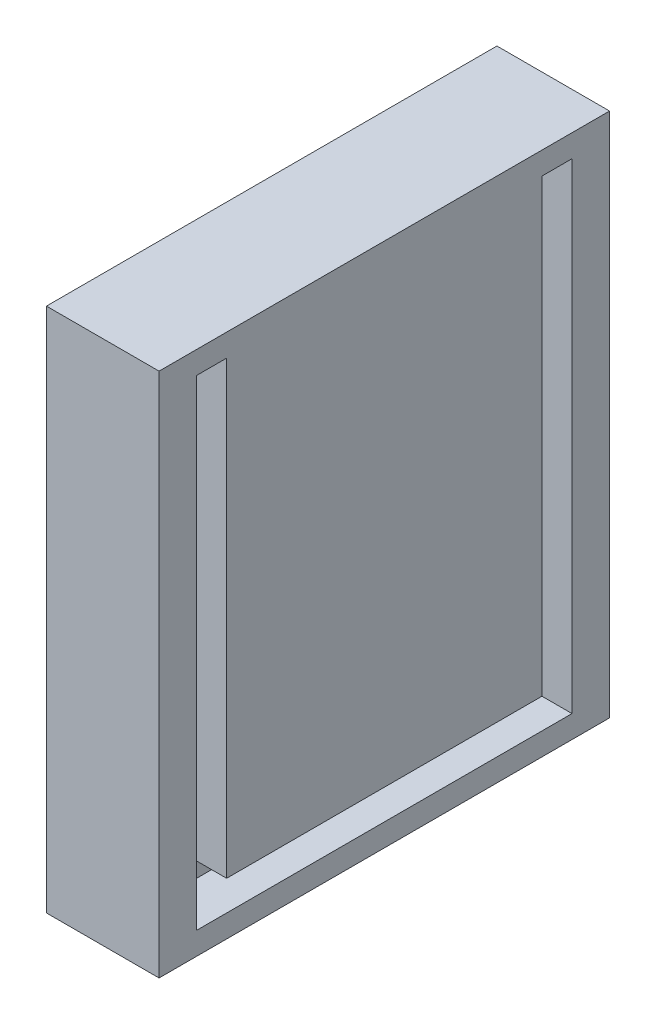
ISO-10303-21;
HEADER;
FILE_DESCRIPTION(('STEP AP214'),'2;1');
FILE_NAME('part.step','',(''),(''),'','','');
FILE_SCHEMA(('AUTOMOTIVE_DESIGN { 1 0 10303 214 1 1 1 1 }'));
ENDSEC;
DATA;
#1=APPLICATION_CONTEXT('core data for automotive mechanical design processes');
#2=APPLICATION_PROTOCOL_DEFINITION('international standard','automotive_design',2000,#1);
#3=PRODUCT_CONTEXT('',#1,'mechanical');
#4=PRODUCT('Part','Part','',(#3));
#5=PRODUCT_RELATED_PRODUCT_CATEGORY('part','',(#4));
#6=PRODUCT_DEFINITION_FORMATION('','',#4);
#7=PRODUCT_DEFINITION_CONTEXT('part definition',#1,'design');
#8=PRODUCT_DEFINITION('design','',#6,#7);
#9=PRODUCT_DEFINITION_SHAPE('','',#8);
#10=(LENGTH_UNIT() NAMED_UNIT(*) SI_UNIT(.MILLI.,.METRE.));
#11=(NAMED_UNIT(*) PLANE_ANGLE_UNIT() SI_UNIT($,.RADIAN.));
#12=(NAMED_UNIT(*) SI_UNIT($,.STERADIAN.) SOLID_ANGLE_UNIT());
#13=UNCERTAINTY_MEASURE_WITH_UNIT(LENGTH_MEASURE(1.E-05),#10,'distance_accuracy_value','');
#14=(GEOMETRIC_REPRESENTATION_CONTEXT(3) GLOBAL_UNCERTAINTY_ASSIGNED_CONTEXT((#13)) GLOBAL_UNIT_ASSIGNED_CONTEXT((#10,
#11,#12)) REPRESENTATION_CONTEXT('',''));
#15=CARTESIAN_POINT('',(0.,0.,0.));
#16=DIRECTION('',(0.,0.,1.));
#17=DIRECTION('',(1.,0.,0.));
#18=AXIS2_PLACEMENT_3D('',#15,#16,#17);
#19=CARTESIAN_POINT('',(7.5,0.,0.));
#20=DIRECTION('',(0.,1.,0.));
#21=DIRECTION('',(0.,0.,1.));
#22=AXIS2_PLACEMENT_3D('',#19,#20,#21);
#23=PLANE('',#22);
#24=DIRECTION('',(0.,0.,-1.));
#25=VECTOR('',#24,1.);
#26=CARTESIAN_POINT('',(0.,0.,0.));
#27=LINE('',#26,#25);
#28=CARTESIAN_POINT('',(0.,0.,0.));
#29=VERTEX_POINT('',#28);
#30=CARTESIAN_POINT('',(0.,0.,-30.));
#31=VERTEX_POINT('',#30);
#32=EDGE_CURVE('E265',#29,#31,#27,.T.);
#33=ORIENTED_EDGE('',*,*,#32,.T.);
#34=DIRECTION('',(-1.,0.,0.));
#35=VECTOR('',#34,1.);
#36=CARTESIAN_POINT('',(7.5,0.,-30.));
#37=LINE('',#36,#35);
#38=CARTESIAN_POINT('',(7.5,0.,-30.));
#39=VERTEX_POINT('',#38);
#40=EDGE_CURVE('E11',#39,#31,#37,.T.);
#41=ORIENTED_EDGE('',*,*,#40,.F.);
#42=DIRECTION('',(0.,0.,-1.));
#43=VECTOR('',#42,1.);
#44=CARTESIAN_POINT('',(7.5,0.,0.));
#45=LINE('',#44,#43);
#46=CARTESIAN_POINT('',(7.5,0.,0.));
#47=VERTEX_POINT('',#46);
#48=EDGE_CURVE('E269',#47,#39,#45,.T.);
#49=ORIENTED_EDGE('',*,*,#48,.F.);
#50=DIRECTION('',(-1.,0.,0.));
#51=VECTOR('',#50,1.);
#52=CARTESIAN_POINT('',(7.5,0.,0.));
#53=LINE('',#52,#51);
#54=EDGE_CURVE('E69',#47,#29,#53,.T.);
#55=ORIENTED_EDGE('',*,*,#54,.T.);
#56=EDGE_LOOP('',(#33,#41,#49,#55));
#57=FACE_BOUND('',#56,.T.);
#58=ADVANCED_FACE('F45',(#57),#23,.F.);
#59=CARTESIAN_POINT('',(7.5,0.,-30.));
#60=DIRECTION('',(0.,0.,1.));
#61=DIRECTION('',(0.,-1.,0.));
#62=AXIS2_PLACEMENT_3D('',#59,#60,#61);
#63=PLANE('',#62);
#64=DIRECTION('',(0.,1.,0.));
#65=VECTOR('',#64,1.);
#66=CARTESIAN_POINT('',(0.,0.,-30.));
#67=LINE('',#66,#65);
#68=CARTESIAN_POINT('',(0.,35.,-30.));
#69=VERTEX_POINT('',#68);
#70=EDGE_CURVE('E284',#31,#69,#67,.T.);
#71=ORIENTED_EDGE('',*,*,#70,.T.);
#72=DIRECTION('',(-1.,0.,0.));
#73=VECTOR('',#72,1.);
#74=CARTESIAN_POINT('',(7.5,35.,-30.));
#75=LINE('',#74,#73);
#76=CARTESIAN_POINT('',(7.5,35.,-30.));
#77=VERTEX_POINT('',#76);
#78=EDGE_CURVE('E53',#77,#69,#75,.T.);
#79=ORIENTED_EDGE('',*,*,#78,.F.);
#80=DIRECTION('',(0.,1.,0.));
#81=VECTOR('',#80,1.);
#82=CARTESIAN_POINT('',(7.5,0.,-30.));
#83=LINE('',#82,#81);
#84=EDGE_CURVE('E95',#39,#77,#83,.T.);
#85=ORIENTED_EDGE('',*,*,#84,.F.);
#86=ORIENTED_EDGE('',*,*,#40,.T.);
#87=EDGE_LOOP('',(#71,#79,#85,#86));
#88=FACE_BOUND('',#87,.T.);
#89=ADVANCED_FACE('F304',(#88),#63,.F.);
#90=CARTESIAN_POINT('',(7.5,35.,0.));
#91=DIRECTION('',(0.,1.,0.));
#92=DIRECTION('',(0.,0.,1.));
#93=AXIS2_PLACEMENT_3D('',#90,#91,#92);
#94=PLANE('',#93);
#95=DIRECTION('',(0.,0.,-1.));
#96=VECTOR('',#95,1.);
#97=CARTESIAN_POINT('',(0.,35.,0.));
#98=LINE('',#97,#96);
#99=CARTESIAN_POINT('',(0.,35.,0.));
#100=VERTEX_POINT('',#99);
#101=EDGE_CURVE('E288',#100,#69,#98,.T.);
#102=ORIENTED_EDGE('',*,*,#101,.F.);
#103=DIRECTION('',(-1.,0.,0.));
#104=VECTOR('',#103,1.);
#105=CARTESIAN_POINT('',(7.5,35.,0.));
#106=LINE('',#105,#104);
#107=CARTESIAN_POINT('',(7.5,35.,0.));
#108=VERTEX_POINT('',#107);
#109=EDGE_CURVE('E297',#108,#100,#106,.T.);
#110=ORIENTED_EDGE('',*,*,#109,.F.);
#111=DIRECTION('',(0.,0.,-1.));
#112=VECTOR('',#111,1.);
#113=CARTESIAN_POINT('',(7.5,35.,0.));
#114=LINE('',#113,#112);
#115=EDGE_CURVE('E275',#108,#77,#114,.T.);
#116=ORIENTED_EDGE('',*,*,#115,.T.);
#117=ORIENTED_EDGE('',*,*,#78,.T.);
#118=EDGE_LOOP('',(#102,#110,#116,#117));
#119=FACE_BOUND('',#118,.T.);
#120=ADVANCED_FACE('F302',(#119),#94,.T.);
#121=CARTESIAN_POINT('',(7.5,0.,0.));
#122=DIRECTION('',(0.,0.,1.));
#123=DIRECTION('',(1.,0.,0.));
#124=AXIS2_PLACEMENT_3D('',#121,#122,#123);
#125=PLANE('',#124);
#126=DIRECTION('',(0.,1.,0.));
#127=VECTOR('',#126,1.);
#128=CARTESIAN_POINT('',(0.,0.,0.));
#129=LINE('',#128,#127);
#130=EDGE_CURVE('E272',#29,#100,#129,.T.);
#131=ORIENTED_EDGE('',*,*,#130,.F.);
#132=ORIENTED_EDGE('',*,*,#54,.F.);
#133=DIRECTION('',(0.,1.,0.));
#134=VECTOR('',#133,1.);
#135=CARTESIAN_POINT('',(7.5,0.,0.));
#136=LINE('',#135,#134);
#137=EDGE_CURVE('E279',#47,#108,#136,.T.);
#138=ORIENTED_EDGE('',*,*,#137,.T.);
#139=ORIENTED_EDGE('',*,*,#109,.T.);
#140=EDGE_LOOP('',(#131,#132,#138,#139));
#141=FACE_BOUND('',#140,.T.);
#142=ADVANCED_FACE('F308',(#141),#125,.T.);
#143=CARTESIAN_POINT('',(7.5,0.,0.));
#144=DIRECTION('',(1.,0.,0.));
#145=DIRECTION('',(0.,0.,-1.));
#146=AXIS2_PLACEMENT_3D('',#143,#144,#145);
#147=PLANE('',#146);
#148=DIRECTION('',(0.,0.,1.));
#149=VECTOR('',#148,1.);
#150=CARTESIAN_POINT('',(7.5,33.5,-4.5));
#151=LINE('',#150,#149);
#152=CARTESIAN_POINT('',(7.5,33.5,-4.5));
#153=VERTEX_POINT('',#152);
#154=CARTESIAN_POINT('',(7.5,33.5,-2.5));
#155=VERTEX_POINT('',#154);
#156=EDGE_CURVE('E60',#153,#155,#151,.T.);
#157=ORIENTED_EDGE('',*,*,#156,.F.);
#158=DIRECTION('',(0.,1.,0.));
#159=VECTOR('',#158,1.);
#160=CARTESIAN_POINT('',(7.5,3.5,-4.5));
#161=LINE('',#160,#159);
#162=CARTESIAN_POINT('',(7.5,3.5,-4.5));
#163=VERTEX_POINT('',#162);
#164=EDGE_CURVE('E166',#163,#153,#161,.T.);
#165=ORIENTED_EDGE('',*,*,#164,.F.);
#166=DIRECTION('',(0.,0.,1.));
#167=VECTOR('',#166,1.);
#168=CARTESIAN_POINT('',(7.5,3.5,-25.5));
#169=LINE('',#168,#167);
#170=CARTESIAN_POINT('',(7.5,3.5,-25.5));
#171=VERTEX_POINT('',#170);
#172=EDGE_CURVE('E170',#171,#163,#169,.T.);
#173=ORIENTED_EDGE('',*,*,#172,.F.);
#174=DIRECTION('',(0.,-1.,0.));
#175=VECTOR('',#174,1.);
#176=CARTESIAN_POINT('',(7.5,33.5,-25.5));
#177=LINE('',#176,#175);
#178=CARTESIAN_POINT('',(7.5,33.5,-25.5));
#179=VERTEX_POINT('',#178);
#180=EDGE_CURVE('E209',#179,#171,#177,.T.);
#181=ORIENTED_EDGE('',*,*,#180,.F.);
#182=DIRECTION('',(0.,0.,1.));
#183=VECTOR('',#182,1.);
#184=CARTESIAN_POINT('',(7.5,33.5,-27.5));
#185=LINE('',#184,#183);
#186=CARTESIAN_POINT('',(7.5,33.5,-27.5));
#187=VERTEX_POINT('',#186);
#188=EDGE_CURVE('E205',#187,#179,#185,.T.);
#189=ORIENTED_EDGE('',*,*,#188,.F.);
#190=DIRECTION('',(0.,1.,0.));
#191=VECTOR('',#190,1.);
#192=CARTESIAN_POINT('',(7.5,1.5,-27.5));
#193=LINE('',#192,#191);
#194=CARTESIAN_POINT('',(7.5,1.5,-27.5));
#195=VERTEX_POINT('',#194);
#196=EDGE_CURVE('E201',#195,#187,#193,.T.);
#197=ORIENTED_EDGE('',*,*,#196,.F.);
#198=DIRECTION('',(0.,0.,-1.));
#199=VECTOR('',#198,1.);
#200=CARTESIAN_POINT('',(7.5,1.5,-2.5));
#201=LINE('',#200,#199);
#202=CARTESIAN_POINT('',(7.5,1.5,-2.5));
#203=VERTEX_POINT('',#202);
#204=EDGE_CURVE('E197',#203,#195,#201,.T.);
#205=ORIENTED_EDGE('',*,*,#204,.F.);
#206=DIRECTION('',(0.,-1.,0.));
#207=VECTOR('',#206,1.);
#208=CARTESIAN_POINT('',(7.5,33.5,-2.5));
#209=LINE('',#208,#207);
#210=EDGE_CURVE('E194',#155,#203,#209,.T.);
#211=ORIENTED_EDGE('',*,*,#210,.F.);
#212=EDGE_LOOP('',(#157,#165,#173,#181,#189,#197,#205,#211));
#213=FACE_BOUND('',#212,.T.);
#214=ORIENTED_EDGE('',*,*,#48,.T.);
#215=ORIENTED_EDGE('',*,*,#84,.T.);
#216=ORIENTED_EDGE('',*,*,#115,.F.);
#217=ORIENTED_EDGE('',*,*,#137,.F.);
#218=EDGE_LOOP('',(#214,#215,#216,#217));
#219=FACE_BOUND('',#218,.T.);
#220=ADVANCED_FACE('F311',(#213,#219),#147,.T.);
#221=CARTESIAN_POINT('',(0.,0.,0.));
#222=DIRECTION('',(1.,0.,0.));
#223=DIRECTION('',(0.,0.,-1.));
#224=AXIS2_PLACEMENT_3D('',#221,#222,#223);
#225=PLANE('',#224);
#226=CARTESIAN_POINT('',(0.,28.5,-9.5));
#227=DIRECTION('',(1.,0.,0.));
#228=DIRECTION('',(0.,0.,-1.));
#229=AXIS2_PLACEMENT_3D('',#226,#227,#228);
#230=CIRCLE('',#229,1.5);
#231=CARTESIAN_POINT('',(0.,28.5,-11.));
#232=VERTEX_POINT('',#231);
#233=EDGE_CURVE('E254',#232,#232,#230,.T.);
#234=ORIENTED_EDGE('',*,*,#233,.T.);
#235=EDGE_LOOP('',(#234));
#236=FACE_BOUND('',#235,.T.);
#237=CARTESIAN_POINT('',(0.,28.5,-21.5));
#238=DIRECTION('',(1.,0.,0.));
#239=DIRECTION('',(0.,0.,-1.));
#240=AXIS2_PLACEMENT_3D('',#237,#238,#239);
#241=CIRCLE('',#240,1.5);
#242=CARTESIAN_POINT('',(0.,28.5,-23.));
#243=VERTEX_POINT('',#242);
#244=EDGE_CURVE('E246',#243,#243,#241,.T.);
#245=ORIENTED_EDGE('',*,*,#244,.T.);
#246=EDGE_LOOP('',(#245));
#247=FACE_BOUND('',#246,.T.);
#248=CARTESIAN_POINT('',(0.,8.5,-21.5000000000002));
#249=DIRECTION('',(1.,0.,0.));
#250=DIRECTION('',(0.,0.,-1.));
#251=AXIS2_PLACEMENT_3D('',#248,#249,#250);
#252=CIRCLE('',#251,1.5);
#253=CARTESIAN_POINT('',(0.,8.5,-23.0000000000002));
#254=VERTEX_POINT('',#253);
#255=EDGE_CURVE('E237',#254,#254,#252,.T.);
#256=ORIENTED_EDGE('',*,*,#255,.T.);
#257=EDGE_LOOP('',(#256));
#258=FACE_BOUND('',#257,.T.);
#259=CARTESIAN_POINT('',(0.,8.5,-9.50000000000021));
#260=DIRECTION('',(1.,0.,0.));
#261=DIRECTION('',(0.,0.,-1.));
#262=AXIS2_PLACEMENT_3D('',#259,#260,#261);
#263=CIRCLE('',#262,1.5);
#264=CARTESIAN_POINT('',(0.,8.5,-11.0000000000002));
#265=VERTEX_POINT('',#264);
#266=EDGE_CURVE('E241',#265,#265,#263,.T.);
#267=ORIENTED_EDGE('',*,*,#266,.T.);
#268=EDGE_LOOP('',(#267));
#269=FACE_BOUND('',#268,.T.);
#270=ORIENTED_EDGE('',*,*,#32,.F.);
#271=ORIENTED_EDGE('',*,*,#130,.T.);
#272=ORIENTED_EDGE('',*,*,#101,.T.);
#273=ORIENTED_EDGE('',*,*,#70,.F.);
#274=EDGE_LOOP('',(#270,#271,#272,#273));
#275=FACE_BOUND('',#274,.T.);
#276=ADVANCED_FACE('F307',(#236,#247,#258,#269,#275),#225,.F.);
#277=CARTESIAN_POINT('',(3.,8.5,-9.50000000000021));
#278=DIRECTION('',(-1.,0.,0.));
#279=DIRECTION('',(0.,0.,1.));
#280=AXIS2_PLACEMENT_3D('',#277,#278,#279);
#281=CYLINDRICAL_SURFACE('',#280,1.5);
#282=CARTESIAN_POINT('',(3.,8.5,-9.50000000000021));
#283=DIRECTION('',(1.,0.,0.));
#284=DIRECTION('',(0.,0.,-1.));
#285=AXIS2_PLACEMENT_3D('',#282,#283,#284);
#286=CIRCLE('',#285,1.5);
#287=CARTESIAN_POINT('',(3.,8.5,-11.0000000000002));
#288=VERTEX_POINT('',#287);
#289=EDGE_CURVE('E261',#288,#288,#286,.T.);
#290=ORIENTED_EDGE('',*,*,#289,.T.);
#291=EDGE_LOOP('',(#290));
#292=FACE_BOUND('',#291,.T.);
#293=ORIENTED_EDGE('',*,*,#266,.F.);
#294=EDGE_LOOP('',(#293));
#295=FACE_BOUND('',#294,.T.);
#296=ADVANCED_FACE('F325',(#292,#295),#281,.F.);
#297=CARTESIAN_POINT('',(3.,0.,0.));
#298=DIRECTION('',(1.,0.,0.));
#299=DIRECTION('',(0.,0.,-1.));
#300=AXIS2_PLACEMENT_3D('',#297,#298,#299);
#301=PLANE('',#300);
#302=ORIENTED_EDGE('',*,*,#289,.F.);
#303=EDGE_LOOP('',(#302));
#304=FACE_BOUND('',#303,.T.);
#305=ADVANCED_FACE('F332',(#304),#301,.F.);
#306=CARTESIAN_POINT('',(3.,8.5,-21.5000000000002));
#307=DIRECTION('',(-1.,0.,0.));
#308=DIRECTION('',(0.,0.,1.));
#309=AXIS2_PLACEMENT_3D('',#306,#307,#308);
#310=CYLINDRICAL_SURFACE('',#309,1.5);
#311=CARTESIAN_POINT('',(3.,8.5,-21.5000000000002));
#312=DIRECTION('',(1.,0.,0.));
#313=DIRECTION('',(0.,0.,-1.));
#314=AXIS2_PLACEMENT_3D('',#311,#312,#313);
#315=CIRCLE('',#314,1.5);
#316=CARTESIAN_POINT('',(3.,8.5,-23.0000000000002));
#317=VERTEX_POINT('',#316);
#318=EDGE_CURVE('E242',#317,#317,#315,.T.);
#319=ORIENTED_EDGE('',*,*,#318,.T.);
#320=EDGE_LOOP('',(#319));
#321=FACE_BOUND('',#320,.T.);
#322=ORIENTED_EDGE('',*,*,#255,.F.);
#323=EDGE_LOOP('',(#322));
#324=FACE_BOUND('',#323,.T.);
#325=ADVANCED_FACE('F336',(#321,#324),#310,.F.);
#326=CARTESIAN_POINT('',(3.,8.5,-21.5000000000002));
#327=DIRECTION('',(1.,0.,0.));
#328=DIRECTION('',(0.,0.,-1.));
#329=AXIS2_PLACEMENT_3D('',#326,#327,#328);
#330=PLANE('',#329);
#331=ORIENTED_EDGE('',*,*,#318,.F.);
#332=EDGE_LOOP('',(#331));
#333=FACE_BOUND('',#332,.T.);
#334=ADVANCED_FACE('F353',(#333),#330,.F.);
#335=CARTESIAN_POINT('',(3.,28.5,-21.5));
#336=DIRECTION('',(-1.,0.,0.));
#337=DIRECTION('',(0.,0.,1.));
#338=AXIS2_PLACEMENT_3D('',#335,#336,#337);
#339=CYLINDRICAL_SURFACE('',#338,1.5);
#340=CARTESIAN_POINT('',(3.,28.5,-21.5));
#341=DIRECTION('',(1.,0.,0.));
#342=DIRECTION('',(0.,0.,-1.));
#343=AXIS2_PLACEMENT_3D('',#340,#341,#342);
#344=CIRCLE('',#343,1.5);
#345=CARTESIAN_POINT('',(3.,28.5,-23.));
#346=VERTEX_POINT('',#345);
#347=EDGE_CURVE('E250',#346,#346,#344,.T.);
#348=ORIENTED_EDGE('',*,*,#347,.T.);
#349=EDGE_LOOP('',(#348));
#350=FACE_BOUND('',#349,.T.);
#351=ORIENTED_EDGE('',*,*,#244,.F.);
#352=EDGE_LOOP('',(#351));
#353=FACE_BOUND('',#352,.T.);
#354=ADVANCED_FACE('F349',(#350,#353),#339,.F.);
#355=CARTESIAN_POINT('',(3.,28.5,-21.5));
#356=DIRECTION('',(1.,0.,0.));
#357=DIRECTION('',(0.,0.,-1.));
#358=AXIS2_PLACEMENT_3D('',#355,#356,#357);
#359=PLANE('',#358);
#360=ORIENTED_EDGE('',*,*,#347,.F.);
#361=EDGE_LOOP('',(#360));
#362=FACE_BOUND('',#361,.T.);
#363=ADVANCED_FACE('F345',(#362),#359,.F.);
#364=CARTESIAN_POINT('',(3.,28.5,-9.5));
#365=DIRECTION('',(-1.,0.,0.));
#366=DIRECTION('',(0.,0.,1.));
#367=AXIS2_PLACEMENT_3D('',#364,#365,#366);
#368=CYLINDRICAL_SURFACE('',#367,1.5);
#369=CARTESIAN_POINT('',(3.,28.5,-9.5));
#370=DIRECTION('',(1.,0.,0.));
#371=DIRECTION('',(0.,0.,-1.));
#372=AXIS2_PLACEMENT_3D('',#369,#370,#371);
#373=CIRCLE('',#372,1.5);
#374=CARTESIAN_POINT('',(3.,28.5,-11.));
#375=VERTEX_POINT('',#374);
#376=EDGE_CURVE('E219',#375,#375,#373,.T.);
#377=ORIENTED_EDGE('',*,*,#376,.T.);
#378=EDGE_LOOP('',(#377));
#379=FACE_BOUND('',#378,.T.);
#380=ORIENTED_EDGE('',*,*,#233,.F.);
#381=EDGE_LOOP('',(#380));
#382=FACE_BOUND('',#381,.T.);
#383=ADVANCED_FACE('F341',(#379,#382),#368,.F.);
#384=CARTESIAN_POINT('',(3.,28.5,-9.5));
#385=DIRECTION('',(1.,0.,0.));
#386=DIRECTION('',(0.,0.,-1.));
#387=AXIS2_PLACEMENT_3D('',#384,#385,#386);
#388=PLANE('',#387);
#389=ORIENTED_EDGE('',*,*,#376,.F.);
#390=EDGE_LOOP('',(#389));
#391=FACE_BOUND('',#390,.T.);
#392=ADVANCED_FACE('F338',(#391),#388,.F.);
#393=CARTESIAN_POINT('',(4.5,33.5,-4.5));
#394=DIRECTION('',(0.,1.,0.));
#395=DIRECTION('',(0.,0.,1.));
#396=AXIS2_PLACEMENT_3D('',#393,#394,#395);
#397=PLANE('',#396);
#398=ORIENTED_EDGE('',*,*,#156,.T.);
#399=DIRECTION('',(1.,0.,0.));
#400=VECTOR('',#399,1.);
#401=CARTESIAN_POINT('',(4.5,33.5,-2.5));
#402=LINE('',#401,#400);
#403=CARTESIAN_POINT('',(4.5,33.5,-2.5));
#404=VERTEX_POINT('',#403);
#405=EDGE_CURVE('E140',#404,#155,#402,.T.);
#406=ORIENTED_EDGE('',*,*,#405,.F.);
#407=DIRECTION('',(0.,0.,1.));
#408=VECTOR('',#407,1.);
#409=CARTESIAN_POINT('',(4.5,33.5,-4.5));
#410=LINE('',#409,#408);
#411=CARTESIAN_POINT('',(4.5,33.5,-4.5));
#412=VERTEX_POINT('',#411);
#413=EDGE_CURVE('E144',#412,#404,#410,.T.);
#414=ORIENTED_EDGE('',*,*,#413,.F.);
#415=DIRECTION('',(1.,0.,0.));
#416=VECTOR('',#415,1.);
#417=CARTESIAN_POINT('',(4.5,33.5,-4.5));
#418=LINE('',#417,#416);
#419=EDGE_CURVE('E216',#412,#153,#418,.T.);
#420=ORIENTED_EDGE('',*,*,#419,.T.);
#421=EDGE_LOOP('',(#398,#406,#414,#420));
#422=FACE_BOUND('',#421,.T.);
#423=ADVANCED_FACE('F142',(#422),#397,.F.);
#424=CARTESIAN_POINT('',(4.5,3.5,-4.5));
#425=DIRECTION('',(0.,0.,-1.));
#426=DIRECTION('',(0.,1.,0.));
#427=AXIS2_PLACEMENT_3D('',#424,#425,#426);
#428=PLANE('',#427);
#429=ORIENTED_EDGE('',*,*,#164,.T.);
#430=ORIENTED_EDGE('',*,*,#419,.F.);
#431=DIRECTION('',(0.,1.,0.));
#432=VECTOR('',#431,1.);
#433=CARTESIAN_POINT('',(4.5,3.5,-4.5));
#434=LINE('',#433,#432);
#435=CARTESIAN_POINT('',(4.5,3.5,-4.5));
#436=VERTEX_POINT('',#435);
#437=EDGE_CURVE('E151',#436,#412,#434,.T.);
#438=ORIENTED_EDGE('',*,*,#437,.F.);
#439=DIRECTION('',(1.,0.,0.));
#440=VECTOR('',#439,1.);
#441=CARTESIAN_POINT('',(4.5,3.5,-4.5));
#442=LINE('',#441,#440);
#443=EDGE_CURVE('E220',#436,#163,#442,.T.);
#444=ORIENTED_EDGE('',*,*,#443,.T.);
#445=EDGE_LOOP('',(#429,#430,#438,#444));
#446=FACE_BOUND('',#445,.T.);
#447=ADVANCED_FACE('F363',(#446),#428,.F.);
#448=CARTESIAN_POINT('',(4.5,3.5,-25.5));
#449=DIRECTION('',(0.,1.,0.));
#450=DIRECTION('',(0.,0.,1.));
#451=AXIS2_PLACEMENT_3D('',#448,#449,#450);
#452=PLANE('',#451);
#453=ORIENTED_EDGE('',*,*,#172,.T.);
#454=ORIENTED_EDGE('',*,*,#443,.F.);
#455=DIRECTION('',(0.,0.,1.));
#456=VECTOR('',#455,1.);
#457=CARTESIAN_POINT('',(4.5,3.5,-25.5));
#458=LINE('',#457,#456);
#459=CARTESIAN_POINT('',(4.5,3.5,-25.5));
#460=VERTEX_POINT('',#459);
#461=EDGE_CURVE('E187',#460,#436,#458,.T.);
#462=ORIENTED_EDGE('',*,*,#461,.F.);
#463=DIRECTION('',(1.,0.,0.));
#464=VECTOR('',#463,1.);
#465=CARTESIAN_POINT('',(4.5,3.5,-25.5));
#466=LINE('',#465,#464);
#467=EDGE_CURVE('E223',#460,#171,#466,.T.);
#468=ORIENTED_EDGE('',*,*,#467,.T.);
#469=EDGE_LOOP('',(#453,#454,#462,#468));
#470=FACE_BOUND('',#469,.T.);
#471=ADVANCED_FACE('F381',(#470),#452,.F.);
#472=CARTESIAN_POINT('',(4.5,33.5,-25.5));
#473=DIRECTION('',(0.,0.,1.));
#474=DIRECTION('',(0.,-1.,0.));
#475=AXIS2_PLACEMENT_3D('',#472,#473,#474);
#476=PLANE('',#475);
#477=ORIENTED_EDGE('',*,*,#180,.T.);
#478=ORIENTED_EDGE('',*,*,#467,.F.);
#479=DIRECTION('',(0.,-1.,0.));
#480=VECTOR('',#479,1.);
#481=CARTESIAN_POINT('',(4.5,33.5,-25.5));
#482=LINE('',#481,#480);
#483=CARTESIAN_POINT('',(4.5,33.5,-25.5));
#484=VERTEX_POINT('',#483);
#485=EDGE_CURVE('E183',#484,#460,#482,.T.);
#486=ORIENTED_EDGE('',*,*,#485,.F.);
#487=DIRECTION('',(1.,0.,0.));
#488=VECTOR('',#487,1.);
#489=CARTESIAN_POINT('',(4.5,33.5,-25.5));
#490=LINE('',#489,#488);
#491=EDGE_CURVE('E226',#484,#179,#490,.T.);
#492=ORIENTED_EDGE('',*,*,#491,.T.);
#493=EDGE_LOOP('',(#477,#478,#486,#492));
#494=FACE_BOUND('',#493,.T.);
#495=ADVANCED_FACE('F377',(#494),#476,.F.);
#496=CARTESIAN_POINT('',(4.5,33.5,-27.5));
#497=DIRECTION('',(0.,1.,0.));
#498=DIRECTION('',(0.,0.,1.));
#499=AXIS2_PLACEMENT_3D('',#496,#497,#498);
#500=PLANE('',#499);
#501=ORIENTED_EDGE('',*,*,#188,.T.);
#502=ORIENTED_EDGE('',*,*,#491,.F.);
#503=DIRECTION('',(0.,0.,1.));
#504=VECTOR('',#503,1.);
#505=CARTESIAN_POINT('',(4.5,33.5,-27.5));
#506=LINE('',#505,#504);
#507=CARTESIAN_POINT('',(4.5,33.5,-27.5));
#508=VERTEX_POINT('',#507);
#509=EDGE_CURVE('E179',#508,#484,#506,.T.);
#510=ORIENTED_EDGE('',*,*,#509,.F.);
#511=DIRECTION('',(1.,0.,0.));
#512=VECTOR('',#511,1.);
#513=CARTESIAN_POINT('',(4.5,33.5,-27.5));
#514=LINE('',#513,#512);
#515=EDGE_CURVE('E229',#508,#187,#514,.T.);
#516=ORIENTED_EDGE('',*,*,#515,.T.);
#517=EDGE_LOOP('',(#501,#502,#510,#516));
#518=FACE_BOUND('',#517,.T.);
#519=ADVANCED_FACE('F373',(#518),#500,.F.);
#520=CARTESIAN_POINT('',(4.5,1.5,-27.5));
#521=DIRECTION('',(0.,0.,-1.));
#522=DIRECTION('',(0.,1.,0.));
#523=AXIS2_PLACEMENT_3D('',#520,#521,#522);
#524=PLANE('',#523);
#525=ORIENTED_EDGE('',*,*,#196,.T.);
#526=ORIENTED_EDGE('',*,*,#515,.F.);
#527=DIRECTION('',(0.,1.,0.));
#528=VECTOR('',#527,1.);
#529=CARTESIAN_POINT('',(4.5,1.5,-27.5));
#530=LINE('',#529,#528);
#531=CARTESIAN_POINT('',(4.5,1.5,-27.5));
#532=VERTEX_POINT('',#531);
#533=EDGE_CURVE('E175',#532,#508,#530,.T.);
#534=ORIENTED_EDGE('',*,*,#533,.F.);
#535=DIRECTION('',(1.,0.,0.));
#536=VECTOR('',#535,1.);
#537=CARTESIAN_POINT('',(4.5,1.5,-27.5));
#538=LINE('',#537,#536);
#539=EDGE_CURVE('E232',#532,#195,#538,.T.);
#540=ORIENTED_EDGE('',*,*,#539,.T.);
#541=EDGE_LOOP('',(#525,#526,#534,#540));
#542=FACE_BOUND('',#541,.T.);
#543=ADVANCED_FACE('F369',(#542),#524,.F.);
#544=CARTESIAN_POINT('',(4.5,1.5,-2.5));
#545=DIRECTION('',(0.,-1.,0.));
#546=DIRECTION('',(0.,0.,-1.));
#547=AXIS2_PLACEMENT_3D('',#544,#545,#546);
#548=PLANE('',#547);
#549=ORIENTED_EDGE('',*,*,#204,.T.);
#550=ORIENTED_EDGE('',*,*,#539,.F.);
#551=DIRECTION('',(0.,0.,-1.));
#552=VECTOR('',#551,1.);
#553=CARTESIAN_POINT('',(4.5,1.5,-2.5));
#554=LINE('',#553,#552);
#555=CARTESIAN_POINT('',(4.5,1.5,-2.5));
#556=VERTEX_POINT('',#555);
#557=EDGE_CURVE('E160',#556,#532,#554,.T.);
#558=ORIENTED_EDGE('',*,*,#557,.F.);
#559=DIRECTION('',(1.,0.,0.));
#560=VECTOR('',#559,1.);
#561=CARTESIAN_POINT('',(4.5,1.5,-2.5));
#562=LINE('',#561,#560);
#563=EDGE_CURVE('E150',#556,#203,#562,.T.);
#564=ORIENTED_EDGE('',*,*,#563,.T.);
#565=EDGE_LOOP('',(#549,#550,#558,#564));
#566=FACE_BOUND('',#565,.T.);
#567=ADVANCED_FACE('F366',(#566),#548,.F.);
#568=CARTESIAN_POINT('',(4.5,33.5,-2.5));
#569=DIRECTION('',(0.,0.,1.));
#570=DIRECTION('',(0.,-1.,0.));
#571=AXIS2_PLACEMENT_3D('',#568,#569,#570);
#572=PLANE('',#571);
#573=ORIENTED_EDGE('',*,*,#210,.T.);
#574=ORIENTED_EDGE('',*,*,#563,.F.);
#575=DIRECTION('',(0.,-1.,0.));
#576=VECTOR('',#575,1.);
#577=CARTESIAN_POINT('',(4.5,33.5,-2.5));
#578=LINE('',#577,#576);
#579=EDGE_CURVE('E154',#404,#556,#578,.T.);
#580=ORIENTED_EDGE('',*,*,#579,.F.);
#581=ORIENTED_EDGE('',*,*,#405,.T.);
#582=EDGE_LOOP('',(#573,#574,#580,#581));
#583=FACE_BOUND('',#582,.T.);
#584=ADVANCED_FACE('F155',(#583),#572,.F.);
#585=CARTESIAN_POINT('',(4.5,0.,0.));
#586=DIRECTION('',(1.,0.,0.));
#587=DIRECTION('',(0.,0.,-1.));
#588=AXIS2_PLACEMENT_3D('',#585,#586,#587);
#589=PLANE('',#588);
#590=ORIENTED_EDGE('',*,*,#413,.T.);
#591=ORIENTED_EDGE('',*,*,#579,.T.);
#592=ORIENTED_EDGE('',*,*,#557,.T.);
#593=ORIENTED_EDGE('',*,*,#533,.T.);
#594=ORIENTED_EDGE('',*,*,#509,.T.);
#595=ORIENTED_EDGE('',*,*,#485,.T.);
#596=ORIENTED_EDGE('',*,*,#461,.T.);
#597=ORIENTED_EDGE('',*,*,#437,.T.);
#598=EDGE_LOOP('',(#590,#591,#592,#593,#594,#595,#596,#597));
#599=FACE_BOUND('',#598,.T.);
#600=ADVANCED_FACE('F162',(#599),#589,.T.);
#601=CLOSED_SHELL('',(#58,#89,#120,#142,#220,#276,#296,#305,#325,#334,#354,#363,#383,#392,#423,
#447,#471,#495,#519,#543,#567,#584,#600));
#602=MANIFOLD_SOLID_BREP('B2',#601);
#603=ADVANCED_BREP_SHAPE_REPRESENTATION('',(#18,#602),#14);
#604=SHAPE_DEFINITION_REPRESENTATION(#9,#603);
ENDSEC;
END-ISO-10303-21;
